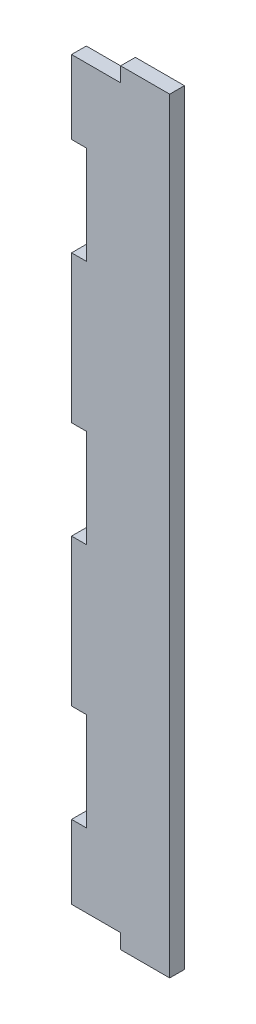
ISO-10303-21;
HEADER;
FILE_DESCRIPTION(('STEP AP214'),'2;1');
FILE_NAME('part.step','',(''),(''),'','','');
FILE_SCHEMA(('AUTOMOTIVE_DESIGN { 1 0 10303 214 1 1 1 1 }'));
ENDSEC;
DATA;
#1=APPLICATION_CONTEXT('core data for automotive mechanical design processes');
#2=APPLICATION_PROTOCOL_DEFINITION('international standard','automotive_design',2000,#1);
#3=PRODUCT_CONTEXT('',#1,'mechanical');
#4=PRODUCT('Part','Part','',(#3));
#5=PRODUCT_RELATED_PRODUCT_CATEGORY('part','',(#4));
#6=PRODUCT_DEFINITION_FORMATION('','',#4);
#7=PRODUCT_DEFINITION_CONTEXT('part definition',#1,'design');
#8=PRODUCT_DEFINITION('design','',#6,#7);
#9=PRODUCT_DEFINITION_SHAPE('','',#8);
#10=(LENGTH_UNIT() NAMED_UNIT(*) SI_UNIT(.MILLI.,.METRE.));
#11=(NAMED_UNIT(*) PLANE_ANGLE_UNIT() SI_UNIT($,.RADIAN.));
#12=(NAMED_UNIT(*) SI_UNIT($,.STERADIAN.) SOLID_ANGLE_UNIT());
#13=UNCERTAINTY_MEASURE_WITH_UNIT(LENGTH_MEASURE(1.E-05),#10,'distance_accuracy_value','');
#14=(GEOMETRIC_REPRESENTATION_CONTEXT(3) GLOBAL_UNCERTAINTY_ASSIGNED_CONTEXT((#13)) GLOBAL_UNIT_ASSIGNED_CONTEXT((#10,
#11,#12)) REPRESENTATION_CONTEXT('',''));
#15=CARTESIAN_POINT('',(0.,0.,0.));
#16=DIRECTION('',(0.,0.,1.));
#17=DIRECTION('',(1.,0.,0.));
#18=AXIS2_PLACEMENT_3D('',#15,#16,#17);
#19=CARTESIAN_POINT('',(-10.,-75.,3.));
#20=DIRECTION('',(1.,0.,0.));
#21=DIRECTION('',(0.,0.,-1.));
#22=AXIS2_PLACEMENT_3D('',#19,#20,#21);
#23=PLANE('',#22);
#24=DIRECTION('',(0.,-1.,0.));
#25=VECTOR('',#24,1.);
#26=CARTESIAN_POINT('',(-10.,-75.,0.));
#27=LINE('',#26,#25);
#28=CARTESIAN_POINT('',(-10.,75.,0.));
#29=VERTEX_POINT('',#28);
#30=CARTESIAN_POINT('',(-10.,60.,0.));
#31=VERTEX_POINT('',#30);
#32=EDGE_CURVE('E197',#29,#31,#27,.T.);
#33=ORIENTED_EDGE('',*,*,#32,.T.);
#34=DIRECTION('',(0.,0.,1.));
#35=VECTOR('',#34,1.);
#36=CARTESIAN_POINT('',(-10.,60.,0.));
#37=LINE('',#36,#35);
#38=CARTESIAN_POINT('',(-10.,60.,3.));
#39=VERTEX_POINT('',#38);
#40=EDGE_CURVE('E284',#31,#39,#37,.T.);
#41=ORIENTED_EDGE('',*,*,#40,.T.);
#42=DIRECTION('',(0.,-1.,0.));
#43=VECTOR('',#42,1.);
#44=CARTESIAN_POINT('',(-10.,-75.,3.));
#45=LINE('',#44,#43);
#46=CARTESIAN_POINT('',(-10.,75.,3.));
#47=VERTEX_POINT('',#46);
#48=EDGE_CURVE('E223',#47,#39,#45,.T.);
#49=ORIENTED_EDGE('',*,*,#48,.F.);
#50=DIRECTION('',(0.,0.,-1.));
#51=VECTOR('',#50,1.);
#52=CARTESIAN_POINT('',(-10.,75.,3.));
#53=LINE('',#52,#51);
#54=EDGE_CURVE('E11',#47,#29,#53,.T.);
#55=ORIENTED_EDGE('',*,*,#54,.T.);
#56=EDGE_LOOP('',(#33,#41,#49,#55));
#57=FACE_BOUND('',#56,.T.);
#58=ADVANCED_FACE('F35',(#57),#23,.F.);
#59=CARTESIAN_POINT('',(-10.,-60.,3.));
#60=VERTEX_POINT('',#59);
#61=CARTESIAN_POINT('',(-10.,-75.,3.));
#62=VERTEX_POINT('',#61);
#63=EDGE_CURVE('E226',#60,#62,#45,.T.);
#64=ORIENTED_EDGE('',*,*,#63,.F.);
#65=DIRECTION('',(0.,0.,1.));
#66=VECTOR('',#65,1.);
#67=CARTESIAN_POINT('',(-10.,-60.,0.));
#68=LINE('',#67,#66);
#69=CARTESIAN_POINT('',(-10.,-60.,0.));
#70=VERTEX_POINT('',#69);
#71=EDGE_CURVE('E297',#70,#60,#68,.T.);
#72=ORIENTED_EDGE('',*,*,#71,.F.);
#73=CARTESIAN_POINT('',(-10.,-75.,0.));
#74=VERTEX_POINT('',#73);
#75=EDGE_CURVE('E200',#70,#74,#27,.T.);
#76=ORIENTED_EDGE('',*,*,#75,.T.);
#77=DIRECTION('',(0.,0.,-1.));
#78=VECTOR('',#77,1.);
#79=CARTESIAN_POINT('',(-10.,-75.,3.));
#80=LINE('',#79,#78);
#81=EDGE_CURVE('E43',#62,#74,#80,.T.);
#82=ORIENTED_EDGE('',*,*,#81,.F.);
#83=EDGE_LOOP('',(#64,#72,#76,#82));
#84=FACE_BOUND('',#83,.T.);
#85=ADVANCED_FACE('F365',(#84),#23,.F.);
#86=CARTESIAN_POINT('',(-10.,40.,3.));
#87=VERTEX_POINT('',#86);
#88=CARTESIAN_POINT('',(-10.,10.,3.));
#89=VERTEX_POINT('',#88);
#90=EDGE_CURVE('E188',#87,#89,#45,.T.);
#91=ORIENTED_EDGE('',*,*,#90,.F.);
#92=DIRECTION('',(0.,0.,1.));
#93=VECTOR('',#92,1.);
#94=CARTESIAN_POINT('',(-10.,40.,0.));
#95=LINE('',#94,#93);
#96=CARTESIAN_POINT('',(-10.,40.,0.));
#97=VERTEX_POINT('',#96);
#98=EDGE_CURVE('E175',#97,#87,#95,.T.);
#99=ORIENTED_EDGE('',*,*,#98,.F.);
#100=CARTESIAN_POINT('',(-10.,10.,0.));
#101=VERTEX_POINT('',#100);
#102=EDGE_CURVE('E186',#97,#101,#27,.T.);
#103=ORIENTED_EDGE('',*,*,#102,.T.);
#104=DIRECTION('',(0.,0.,1.));
#105=VECTOR('',#104,1.);
#106=CARTESIAN_POINT('',(-10.,10.,0.));
#107=LINE('',#106,#105);
#108=EDGE_CURVE('E263',#101,#89,#107,.T.);
#109=ORIENTED_EDGE('',*,*,#108,.T.);
#110=EDGE_LOOP('',(#91,#99,#103,#109));
#111=FACE_BOUND('',#110,.T.);
#112=ADVANCED_FACE('F184',(#111),#23,.F.);
#113=CARTESIAN_POINT('',(-10.,-75.,3.));
#114=DIRECTION('',(0.,1.,0.));
#115=DIRECTION('',(0.,0.,1.));
#116=AXIS2_PLACEMENT_3D('',#113,#114,#115);
#117=PLANE('',#116);
#118=DIRECTION('',(0.,0.,-1.));
#119=VECTOR('',#118,1.);
#120=CARTESIAN_POINT('',(0.,-75.,3.));
#121=LINE('',#120,#119);
#122=CARTESIAN_POINT('',(0.,-75.,3.));
#123=VERTEX_POINT('',#122);
#124=CARTESIAN_POINT('',(0.,-75.,0.));
#125=VERTEX_POINT('',#124);
#126=EDGE_CURVE('E245',#123,#125,#121,.T.);
#127=ORIENTED_EDGE('',*,*,#126,.F.);
#128=DIRECTION('',(1.,0.,0.));
#129=VECTOR('',#128,1.);
#130=CARTESIAN_POINT('',(-10.,-75.,3.));
#131=LINE('',#130,#129);
#132=EDGE_CURVE('E220',#62,#123,#131,.T.);
#133=ORIENTED_EDGE('',*,*,#132,.F.);
#134=ORIENTED_EDGE('',*,*,#81,.T.);
#135=DIRECTION('',(1.,0.,0.));
#136=VECTOR('',#135,1.);
#137=CARTESIAN_POINT('',(-10.,-75.,0.));
#138=LINE('',#137,#136);
#139=EDGE_CURVE('E202',#74,#125,#138,.T.);
#140=ORIENTED_EDGE('',*,*,#139,.T.);
#141=EDGE_LOOP('',(#127,#133,#134,#140));
#142=FACE_BOUND('',#141,.T.);
#143=ADVANCED_FACE('F361',(#142),#117,.F.);
#144=CARTESIAN_POINT('',(10.,-75.,3.));
#145=DIRECTION('',(-1.,0.,0.));
#146=DIRECTION('',(0.,0.,1.));
#147=AXIS2_PLACEMENT_3D('',#144,#145,#146);
#148=PLANE('',#147);
#149=DIRECTION('',(0.,1.,0.));
#150=VECTOR('',#149,1.);
#151=CARTESIAN_POINT('',(10.,-75.,0.));
#152=LINE('',#151,#150);
#153=CARTESIAN_POINT('',(10.,-78.,0.));
#154=VERTEX_POINT('',#153);
#155=CARTESIAN_POINT('',(10.,78.,0.));
#156=VERTEX_POINT('',#155);
#157=EDGE_CURVE('E212',#154,#156,#152,.T.);
#158=ORIENTED_EDGE('',*,*,#157,.T.);
#159=DIRECTION('',(0.,0.,-1.));
#160=VECTOR('',#159,1.);
#161=CARTESIAN_POINT('',(10.,78.,3.));
#162=LINE('',#161,#160);
#163=CARTESIAN_POINT('',(10.,78.,3.));
#164=VERTEX_POINT('',#163);
#165=EDGE_CURVE('E233',#164,#156,#162,.T.);
#166=ORIENTED_EDGE('',*,*,#165,.F.);
#167=DIRECTION('',(0.,1.,0.));
#168=VECTOR('',#167,1.);
#169=CARTESIAN_POINT('',(10.,-75.,3.));
#170=LINE('',#169,#168);
#171=CARTESIAN_POINT('',(10.,-78.,3.));
#172=VERTEX_POINT('',#171);
#173=EDGE_CURVE('E230',#172,#164,#170,.T.);
#174=ORIENTED_EDGE('',*,*,#173,.F.);
#175=DIRECTION('',(0.,0.,-1.));
#176=VECTOR('',#175,1.);
#177=CARTESIAN_POINT('',(10.,-78.,3.));
#178=LINE('',#177,#176);
#179=EDGE_CURVE('E253',#172,#154,#178,.T.);
#180=ORIENTED_EDGE('',*,*,#179,.T.);
#181=EDGE_LOOP('',(#158,#166,#174,#180));
#182=FACE_BOUND('',#181,.T.);
#183=ADVANCED_FACE('F37',(#182),#148,.F.);
#184=CARTESIAN_POINT('',(-10.,75.,3.));
#185=DIRECTION('',(0.,-1.,0.));
#186=DIRECTION('',(0.,0.,-1.));
#187=AXIS2_PLACEMENT_3D('',#184,#185,#186);
#188=PLANE('',#187);
#189=DIRECTION('',(-1.,0.,0.));
#190=VECTOR('',#189,1.);
#191=CARTESIAN_POINT('',(-10.,75.,3.));
#192=LINE('',#191,#190);
#193=CARTESIAN_POINT('',(0.,75.,3.));
#194=VERTEX_POINT('',#193);
#195=EDGE_CURVE('E228',#194,#47,#192,.T.);
#196=ORIENTED_EDGE('',*,*,#195,.F.);
#197=DIRECTION('',(0.,0.,-1.));
#198=VECTOR('',#197,1.);
#199=CARTESIAN_POINT('',(0.,75.,3.));
#200=LINE('',#199,#198);
#201=CARTESIAN_POINT('',(0.,75.,0.));
#202=VERTEX_POINT('',#201);
#203=EDGE_CURVE('E217',#194,#202,#200,.T.);
#204=ORIENTED_EDGE('',*,*,#203,.T.);
#205=DIRECTION('',(-1.,0.,0.));
#206=VECTOR('',#205,1.);
#207=CARTESIAN_POINT('',(-10.,75.,0.));
#208=LINE('',#207,#206);
#209=EDGE_CURVE('E206',#202,#29,#208,.T.);
#210=ORIENTED_EDGE('',*,*,#209,.T.);
#211=ORIENTED_EDGE('',*,*,#54,.F.);
#212=EDGE_LOOP('',(#196,#204,#210,#211));
#213=FACE_BOUND('',#212,.T.);
#214=ADVANCED_FACE('F332',(#213),#188,.F.);
#215=CARTESIAN_POINT('',(-10.,-10.,0.));
#216=VERTEX_POINT('',#215);
#217=CARTESIAN_POINT('',(-10.,-40.,0.));
#218=VERTEX_POINT('',#217);
#219=EDGE_CURVE('E198',#216,#218,#27,.T.);
#220=ORIENTED_EDGE('',*,*,#219,.T.);
#221=DIRECTION('',(0.,0.,1.));
#222=VECTOR('',#221,1.);
#223=CARTESIAN_POINT('',(-10.,-40.,0.));
#224=LINE('',#223,#222);
#225=CARTESIAN_POINT('',(-10.,-40.,3.));
#226=VERTEX_POINT('',#225);
#227=EDGE_CURVE('E294',#218,#226,#224,.T.);
#228=ORIENTED_EDGE('',*,*,#227,.T.);
#229=CARTESIAN_POINT('',(-10.,-10.,3.));
#230=VERTEX_POINT('',#229);
#231=EDGE_CURVE('E227',#230,#226,#45,.T.);
#232=ORIENTED_EDGE('',*,*,#231,.F.);
#233=DIRECTION('',(0.,0.,1.));
#234=VECTOR('',#233,1.);
#235=CARTESIAN_POINT('',(-10.,-10.,0.));
#236=LINE('',#235,#234);
#237=EDGE_CURVE('E267',#216,#230,#236,.T.);
#238=ORIENTED_EDGE('',*,*,#237,.F.);
#239=EDGE_LOOP('',(#220,#228,#232,#238));
#240=FACE_BOUND('',#239,.T.);
#241=ADVANCED_FACE('F372',(#240),#23,.F.);
#242=CARTESIAN_POINT('',(0.,0.,3.));
#243=DIRECTION('',(0.,0.,-1.));
#244=DIRECTION('',(-1.,0.,0.));
#245=AXIS2_PLACEMENT_3D('',#242,#243,#244);
#246=PLANE('',#245);
#247=ORIENTED_EDGE('',*,*,#48,.T.);
#248=DIRECTION('',(-1.,0.,0.));
#249=VECTOR('',#248,1.);
#250=CARTESIAN_POINT('',(-10.,60.,3.));
#251=LINE('',#250,#249);
#252=CARTESIAN_POINT('',(-7.,60.,3.));
#253=VERTEX_POINT('',#252);
#254=EDGE_CURVE('E180',#253,#39,#251,.T.);
#255=ORIENTED_EDGE('',*,*,#254,.F.);
#256=DIRECTION('',(0.,1.,0.));
#257=VECTOR('',#256,1.);
#258=CARTESIAN_POINT('',(-7.,60.,3.));
#259=LINE('',#258,#257);
#260=CARTESIAN_POINT('',(-7.,40.,3.));
#261=VERTEX_POINT('',#260);
#262=EDGE_CURVE('E321',#261,#253,#259,.T.);
#263=ORIENTED_EDGE('',*,*,#262,.F.);
#264=DIRECTION('',(1.,0.,0.));
#265=VECTOR('',#264,1.);
#266=CARTESIAN_POINT('',(-10.,40.,3.));
#267=LINE('',#266,#265);
#268=EDGE_CURVE('E299',#87,#261,#267,.T.);
#269=ORIENTED_EDGE('',*,*,#268,.F.);
#270=ORIENTED_EDGE('',*,*,#90,.T.);
#271=DIRECTION('',(-1.,0.,0.));
#272=VECTOR('',#271,1.);
#273=CARTESIAN_POINT('',(-10.,10.,3.));
#274=LINE('',#273,#272);
#275=CARTESIAN_POINT('',(-7.00000000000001,10.,3.));
#276=VERTEX_POINT('',#275);
#277=EDGE_CURVE('E274',#276,#89,#274,.T.);
#278=ORIENTED_EDGE('',*,*,#277,.F.);
#279=DIRECTION('',(0.,1.,0.));
#280=VECTOR('',#279,1.);
#281=CARTESIAN_POINT('',(-7.00000000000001,10.,3.));
#282=LINE('',#281,#280);
#283=CARTESIAN_POINT('',(-7.00000000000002,-10.,3.));
#284=VERTEX_POINT('',#283);
#285=EDGE_CURVE('E278',#284,#276,#282,.T.);
#286=ORIENTED_EDGE('',*,*,#285,.F.);
#287=DIRECTION('',(1.,0.,0.));
#288=VECTOR('',#287,1.);
#289=CARTESIAN_POINT('',(-10.,-10.,3.));
#290=LINE('',#289,#288);
#291=EDGE_CURVE('E281',#230,#284,#290,.T.);
#292=ORIENTED_EDGE('',*,*,#291,.F.);
#293=ORIENTED_EDGE('',*,*,#231,.T.);
#294=DIRECTION('',(-1.,0.,0.));
#295=VECTOR('',#294,1.);
#296=CARTESIAN_POINT('',(-10.,-40.,3.));
#297=LINE('',#296,#295);
#298=CARTESIAN_POINT('',(-7.,-40.,3.));
#299=VERTEX_POINT('',#298);
#300=EDGE_CURVE('E300',#299,#226,#297,.T.);
#301=ORIENTED_EDGE('',*,*,#300,.F.);
#302=DIRECTION('',(0.,1.,0.));
#303=VECTOR('',#302,1.);
#304=CARTESIAN_POINT('',(-7.,-60.,3.));
#305=LINE('',#304,#303);
#306=CARTESIAN_POINT('',(-7.,-60.,3.));
#307=VERTEX_POINT('',#306);
#308=EDGE_CURVE('E303',#307,#299,#305,.T.);
#309=ORIENTED_EDGE('',*,*,#308,.F.);
#310=DIRECTION('',(1.,0.,0.));
#311=VECTOR('',#310,1.);
#312=CARTESIAN_POINT('',(-10.,-60.,3.));
#313=LINE('',#312,#311);
#314=EDGE_CURVE('E306',#60,#307,#313,.T.);
#315=ORIENTED_EDGE('',*,*,#314,.F.);
#316=ORIENTED_EDGE('',*,*,#63,.T.);
#317=ORIENTED_EDGE('',*,*,#132,.T.);
#318=DIRECTION('',(0.,-1.,0.));
#319=VECTOR('',#318,1.);
#320=CARTESIAN_POINT('',(0.,-75.,3.));
#321=LINE('',#320,#319);
#322=CARTESIAN_POINT('',(0.,-78.,3.));
#323=VERTEX_POINT('',#322);
#324=EDGE_CURVE('E260',#123,#323,#321,.T.);
#325=ORIENTED_EDGE('',*,*,#324,.T.);
#326=DIRECTION('',(1.,0.,0.));
#327=VECTOR('',#326,1.);
#328=CARTESIAN_POINT('',(0.,-78.,3.));
#329=LINE('',#328,#327);
#330=EDGE_CURVE('E256',#323,#172,#329,.T.);
#331=ORIENTED_EDGE('',*,*,#330,.T.);
#332=ORIENTED_EDGE('',*,*,#173,.T.);
#333=DIRECTION('',(-1.,0.,0.));
#334=VECTOR('',#333,1.);
#335=CARTESIAN_POINT('',(0.,78.,3.));
#336=LINE('',#335,#334);
#337=CARTESIAN_POINT('',(0.,78.,3.));
#338=VERTEX_POINT('',#337);
#339=EDGE_CURVE('E239',#164,#338,#336,.T.);
#340=ORIENTED_EDGE('',*,*,#339,.T.);
#341=DIRECTION('',(0.,-1.,0.));
#342=VECTOR('',#341,1.);
#343=CARTESIAN_POINT('',(0.,75.,3.));
#344=LINE('',#343,#342);
#345=EDGE_CURVE('E242',#338,#194,#344,.T.);
#346=ORIENTED_EDGE('',*,*,#345,.T.);
#347=ORIENTED_EDGE('',*,*,#195,.T.);
#348=EDGE_LOOP('',(#247,#255,#263,#269,#270,#278,#286,#292,#293,#301,#309,#315,#316,#317,#325,
#331,#332,#340,#346,#347));
#349=FACE_BOUND('',#348,.T.);
#350=ADVANCED_FACE('F335',(#349),#246,.F.);
#351=CARTESIAN_POINT('',(0.,0.,0.));
#352=DIRECTION('',(0.,0.,-1.));
#353=DIRECTION('',(-1.,0.,0.));
#354=AXIS2_PLACEMENT_3D('',#351,#352,#353);
#355=PLANE('',#354);
#356=DIRECTION('',(-1.,0.,0.));
#357=VECTOR('',#356,1.);
#358=CARTESIAN_POINT('',(-10.,60.,0.));
#359=LINE('',#358,#357);
#360=CARTESIAN_POINT('',(-7.,60.,0.));
#361=VERTEX_POINT('',#360);
#362=EDGE_CURVE('E189',#361,#31,#359,.T.);
#363=ORIENTED_EDGE('',*,*,#362,.T.);
#364=ORIENTED_EDGE('',*,*,#32,.F.);
#365=ORIENTED_EDGE('',*,*,#209,.F.);
#366=DIRECTION('',(0.,-1.,0.));
#367=VECTOR('',#366,1.);
#368=CARTESIAN_POINT('',(0.,75.,0.));
#369=LINE('',#368,#367);
#370=CARTESIAN_POINT('',(0.,78.,0.));
#371=VERTEX_POINT('',#370);
#372=EDGE_CURVE('E243',#371,#202,#369,.T.);
#373=ORIENTED_EDGE('',*,*,#372,.F.);
#374=DIRECTION('',(-1.,0.,0.));
#375=VECTOR('',#374,1.);
#376=CARTESIAN_POINT('',(0.,78.,0.));
#377=LINE('',#376,#375);
#378=EDGE_CURVE('E240',#156,#371,#377,.T.);
#379=ORIENTED_EDGE('',*,*,#378,.F.);
#380=ORIENTED_EDGE('',*,*,#157,.F.);
#381=DIRECTION('',(1.,0.,0.));
#382=VECTOR('',#381,1.);
#383=CARTESIAN_POINT('',(0.,-78.,0.));
#384=LINE('',#383,#382);
#385=CARTESIAN_POINT('',(0.,-78.,0.));
#386=VERTEX_POINT('',#385);
#387=EDGE_CURVE('E257',#386,#154,#384,.T.);
#388=ORIENTED_EDGE('',*,*,#387,.F.);
#389=DIRECTION('',(0.,-1.,0.));
#390=VECTOR('',#389,1.);
#391=CARTESIAN_POINT('',(0.,-75.,0.));
#392=LINE('',#391,#390);
#393=EDGE_CURVE('E261',#125,#386,#392,.T.);
#394=ORIENTED_EDGE('',*,*,#393,.F.);
#395=ORIENTED_EDGE('',*,*,#139,.F.);
#396=ORIENTED_EDGE('',*,*,#75,.F.);
#397=DIRECTION('',(1.,0.,0.));
#398=VECTOR('',#397,1.);
#399=CARTESIAN_POINT('',(-10.,-60.,0.));
#400=LINE('',#399,#398);
#401=CARTESIAN_POINT('',(-7.,-60.,0.));
#402=VERTEX_POINT('',#401);
#403=EDGE_CURVE('E302',#70,#402,#400,.T.);
#404=ORIENTED_EDGE('',*,*,#403,.T.);
#405=DIRECTION('',(0.,1.,0.));
#406=VECTOR('',#405,1.);
#407=CARTESIAN_POINT('',(-7.,-60.,0.));
#408=LINE('',#407,#406);
#409=CARTESIAN_POINT('',(-7.,-40.,0.));
#410=VERTEX_POINT('',#409);
#411=EDGE_CURVE('E310',#402,#410,#408,.T.);
#412=ORIENTED_EDGE('',*,*,#411,.T.);
#413=DIRECTION('',(-1.,0.,0.));
#414=VECTOR('',#413,1.);
#415=CARTESIAN_POINT('',(-10.,-40.,0.));
#416=LINE('',#415,#414);
#417=EDGE_CURVE('E58',#410,#218,#416,.T.);
#418=ORIENTED_EDGE('',*,*,#417,.T.);
#419=ORIENTED_EDGE('',*,*,#219,.F.);
#420=DIRECTION('',(1.,0.,0.));
#421=VECTOR('',#420,1.);
#422=CARTESIAN_POINT('',(-10.,-10.,0.));
#423=LINE('',#422,#421);
#424=CARTESIAN_POINT('',(-7.00000000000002,-10.,0.));
#425=VERTEX_POINT('',#424);
#426=EDGE_CURVE('E277',#216,#425,#423,.T.);
#427=ORIENTED_EDGE('',*,*,#426,.T.);
#428=DIRECTION('',(0.,1.,0.));
#429=VECTOR('',#428,1.);
#430=CARTESIAN_POINT('',(-7.00000000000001,10.,0.));
#431=LINE('',#430,#429);
#432=CARTESIAN_POINT('',(-7.00000000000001,10.,0.));
#433=VERTEX_POINT('',#432);
#434=EDGE_CURVE('E286',#425,#433,#431,.T.);
#435=ORIENTED_EDGE('',*,*,#434,.T.);
#436=DIRECTION('',(-1.,0.,0.));
#437=VECTOR('',#436,1.);
#438=CARTESIAN_POINT('',(-10.,10.,0.));
#439=LINE('',#438,#437);
#440=EDGE_CURVE('E196',#433,#101,#439,.T.);
#441=ORIENTED_EDGE('',*,*,#440,.T.);
#442=ORIENTED_EDGE('',*,*,#102,.F.);
#443=DIRECTION('',(1.,0.,0.));
#444=VECTOR('',#443,1.);
#445=CARTESIAN_POINT('',(-10.,40.,0.));
#446=LINE('',#445,#444);
#447=CARTESIAN_POINT('',(-7.,40.,0.));
#448=VERTEX_POINT('',#447);
#449=EDGE_CURVE('E171',#97,#448,#446,.T.);
#450=ORIENTED_EDGE('',*,*,#449,.T.);
#451=DIRECTION('',(0.,1.,0.));
#452=VECTOR('',#451,1.);
#453=CARTESIAN_POINT('',(-7.,60.,0.));
#454=LINE('',#453,#452);
#455=EDGE_CURVE('E50',#448,#361,#454,.T.);
#456=ORIENTED_EDGE('',*,*,#455,.T.);
#457=EDGE_LOOP('',(#363,#364,#365,#373,#379,#380,#388,#394,#395,#396,#404,#412,#418,#419,#427,
#435,#441,#442,#450,#456));
#458=FACE_BOUND('',#457,.T.);
#459=ADVANCED_FACE('F193',(#458),#355,.T.);
#460=CARTESIAN_POINT('',(0.,75.,3.));
#461=DIRECTION('',(1.,0.,0.));
#462=DIRECTION('',(0.,0.,-1.));
#463=AXIS2_PLACEMENT_3D('',#460,#461,#462);
#464=PLANE('',#463);
#465=ORIENTED_EDGE('',*,*,#372,.T.);
#466=ORIENTED_EDGE('',*,*,#203,.F.);
#467=ORIENTED_EDGE('',*,*,#345,.F.);
#468=DIRECTION('',(0.,0.,-1.));
#469=VECTOR('',#468,1.);
#470=CARTESIAN_POINT('',(0.,78.,3.));
#471=LINE('',#470,#469);
#472=EDGE_CURVE('E236',#338,#371,#471,.T.);
#473=ORIENTED_EDGE('',*,*,#472,.T.);
#474=EDGE_LOOP('',(#465,#466,#467,#473));
#475=FACE_BOUND('',#474,.T.);
#476=ADVANCED_FACE('F341',(#475),#464,.F.);
#477=CARTESIAN_POINT('',(0.,78.,3.));
#478=DIRECTION('',(0.,-1.,0.));
#479=DIRECTION('',(0.,0.,-1.));
#480=AXIS2_PLACEMENT_3D('',#477,#478,#479);
#481=PLANE('',#480);
#482=ORIENTED_EDGE('',*,*,#378,.T.);
#483=ORIENTED_EDGE('',*,*,#472,.F.);
#484=ORIENTED_EDGE('',*,*,#339,.F.);
#485=ORIENTED_EDGE('',*,*,#165,.T.);
#486=EDGE_LOOP('',(#482,#483,#484,#485));
#487=FACE_BOUND('',#486,.T.);
#488=ADVANCED_FACE('F346',(#487),#481,.F.);
#489=CARTESIAN_POINT('',(0.,-75.,3.));
#490=DIRECTION('',(1.,0.,0.));
#491=DIRECTION('',(0.,0.,-1.));
#492=AXIS2_PLACEMENT_3D('',#489,#490,#491);
#493=PLANE('',#492);
#494=ORIENTED_EDGE('',*,*,#393,.T.);
#495=DIRECTION('',(0.,0.,-1.));
#496=VECTOR('',#495,1.);
#497=CARTESIAN_POINT('',(0.,-78.,3.));
#498=LINE('',#497,#496);
#499=EDGE_CURVE('E250',#323,#386,#498,.T.);
#500=ORIENTED_EDGE('',*,*,#499,.F.);
#501=ORIENTED_EDGE('',*,*,#324,.F.);
#502=ORIENTED_EDGE('',*,*,#126,.T.);
#503=EDGE_LOOP('',(#494,#500,#501,#502));
#504=FACE_BOUND('',#503,.T.);
#505=ADVANCED_FACE('F358',(#504),#493,.F.);
#506=CARTESIAN_POINT('',(0.,-78.,3.));
#507=DIRECTION('',(0.,1.,0.));
#508=DIRECTION('',(0.,0.,1.));
#509=AXIS2_PLACEMENT_3D('',#506,#507,#508);
#510=PLANE('',#509);
#511=ORIENTED_EDGE('',*,*,#387,.T.);
#512=ORIENTED_EDGE('',*,*,#179,.F.);
#513=ORIENTED_EDGE('',*,*,#330,.F.);
#514=ORIENTED_EDGE('',*,*,#499,.T.);
#515=EDGE_LOOP('',(#511,#512,#513,#514));
#516=FACE_BOUND('',#515,.T.);
#517=ADVANCED_FACE('F352',(#516),#510,.F.);
#518=CARTESIAN_POINT('',(-10.,10.,0.));
#519=DIRECTION('',(0.,1.,0.));
#520=DIRECTION('',(0.,0.,1.));
#521=AXIS2_PLACEMENT_3D('',#518,#519,#520);
#522=PLANE('',#521);
#523=ORIENTED_EDGE('',*,*,#277,.T.);
#524=ORIENTED_EDGE('',*,*,#108,.F.);
#525=ORIENTED_EDGE('',*,*,#440,.F.);
#526=DIRECTION('',(0.,0.,1.));
#527=VECTOR('',#526,1.);
#528=CARTESIAN_POINT('',(-7.00000000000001,10.,0.));
#529=LINE('',#528,#527);
#530=EDGE_CURVE('E271',#433,#276,#529,.T.);
#531=ORIENTED_EDGE('',*,*,#530,.T.);
#532=EDGE_LOOP('',(#523,#524,#525,#531));
#533=FACE_BOUND('',#532,.T.);
#534=ADVANCED_FACE('F426',(#533),#522,.F.);
#535=CARTESIAN_POINT('',(-7.00000000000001,10.,0.));
#536=DIRECTION('',(1.,0.,0.));
#537=DIRECTION('',(0.,1.,0.));
#538=AXIS2_PLACEMENT_3D('',#535,#536,#537);
#539=PLANE('',#538);
#540=ORIENTED_EDGE('',*,*,#285,.T.);
#541=ORIENTED_EDGE('',*,*,#530,.F.);
#542=ORIENTED_EDGE('',*,*,#434,.F.);
#543=DIRECTION('',(0.,0.,1.));
#544=VECTOR('',#543,1.);
#545=CARTESIAN_POINT('',(-7.00000000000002,-10.,0.));
#546=LINE('',#545,#544);
#547=EDGE_CURVE('E269',#425,#284,#546,.T.);
#548=ORIENTED_EDGE('',*,*,#547,.T.);
#549=EDGE_LOOP('',(#540,#541,#542,#548));
#550=FACE_BOUND('',#549,.T.);
#551=ADVANCED_FACE('F431',(#550),#539,.F.);
#552=CARTESIAN_POINT('',(-10.,-10.,0.));
#553=DIRECTION('',(0.,-1.,0.));
#554=DIRECTION('',(0.,0.,-1.));
#555=AXIS2_PLACEMENT_3D('',#552,#553,#554);
#556=PLANE('',#555);
#557=ORIENTED_EDGE('',*,*,#291,.T.);
#558=ORIENTED_EDGE('',*,*,#547,.F.);
#559=ORIENTED_EDGE('',*,*,#426,.F.);
#560=ORIENTED_EDGE('',*,*,#237,.T.);
#561=EDGE_LOOP('',(#557,#558,#559,#560));
#562=FACE_BOUND('',#561,.T.);
#563=ADVANCED_FACE('F443',(#562),#556,.F.);
#564=CARTESIAN_POINT('',(-10.,-60.,0.));
#565=DIRECTION('',(0.,-1.,0.));
#566=DIRECTION('',(0.,0.,-1.));
#567=AXIS2_PLACEMENT_3D('',#564,#565,#566);
#568=PLANE('',#567);
#569=ORIENTED_EDGE('',*,*,#314,.T.);
#570=DIRECTION('',(0.,0.,1.));
#571=VECTOR('',#570,1.);
#572=CARTESIAN_POINT('',(-7.,-60.,0.));
#573=LINE('',#572,#571);
#574=EDGE_CURVE('E290',#402,#307,#573,.T.);
#575=ORIENTED_EDGE('',*,*,#574,.F.);
#576=ORIENTED_EDGE('',*,*,#403,.F.);
#577=ORIENTED_EDGE('',*,*,#71,.T.);
#578=EDGE_LOOP('',(#569,#575,#576,#577));
#579=FACE_BOUND('',#578,.T.);
#580=ADVANCED_FACE('F453',(#579),#568,.F.);
#581=CARTESIAN_POINT('',(-10.,-40.,0.));
#582=DIRECTION('',(0.,1.,0.));
#583=DIRECTION('',(0.,0.,1.));
#584=AXIS2_PLACEMENT_3D('',#581,#582,#583);
#585=PLANE('',#584);
#586=ORIENTED_EDGE('',*,*,#300,.T.);
#587=ORIENTED_EDGE('',*,*,#227,.F.);
#588=ORIENTED_EDGE('',*,*,#417,.F.);
#589=DIRECTION('',(0.,0.,1.));
#590=VECTOR('',#589,1.);
#591=CARTESIAN_POINT('',(-7.,-40.,0.));
#592=LINE('',#591,#590);
#593=EDGE_CURVE('E292',#410,#299,#592,.T.);
#594=ORIENTED_EDGE('',*,*,#593,.T.);
#595=EDGE_LOOP('',(#586,#587,#588,#594));
#596=FACE_BOUND('',#595,.T.);
#597=ADVANCED_FACE('F463',(#596),#585,.F.);
#598=CARTESIAN_POINT('',(-7.,-60.,0.));
#599=DIRECTION('',(1.,0.,0.));
#600=DIRECTION('',(0.,1.,0.));
#601=AXIS2_PLACEMENT_3D('',#598,#599,#600);
#602=PLANE('',#601);
#603=ORIENTED_EDGE('',*,*,#308,.T.);
#604=ORIENTED_EDGE('',*,*,#593,.F.);
#605=ORIENTED_EDGE('',*,*,#411,.F.);
#606=ORIENTED_EDGE('',*,*,#574,.T.);
#607=EDGE_LOOP('',(#603,#604,#605,#606));
#608=FACE_BOUND('',#607,.T.);
#609=ADVANCED_FACE('F473',(#608),#602,.F.);
#610=CARTESIAN_POINT('',(-10.,60.,0.));
#611=DIRECTION('',(0.,1.,0.));
#612=DIRECTION('',(0.,0.,1.));
#613=AXIS2_PLACEMENT_3D('',#610,#611,#612);
#614=PLANE('',#613);
#615=ORIENTED_EDGE('',*,*,#254,.T.);
#616=ORIENTED_EDGE('',*,*,#40,.F.);
#617=ORIENTED_EDGE('',*,*,#362,.F.);
#618=DIRECTION('',(0.,0.,1.));
#619=VECTOR('',#618,1.);
#620=CARTESIAN_POINT('',(-7.,60.,0.));
#621=LINE('',#620,#619);
#622=EDGE_CURVE('E316',#361,#253,#621,.T.);
#623=ORIENTED_EDGE('',*,*,#622,.T.);
#624=EDGE_LOOP('',(#615,#616,#617,#623));
#625=FACE_BOUND('',#624,.T.);
#626=ADVANCED_FACE('F482',(#625),#614,.F.);
#627=CARTESIAN_POINT('',(-7.,60.,0.));
#628=DIRECTION('',(1.,0.,0.));
#629=DIRECTION('',(0.,1.,0.));
#630=AXIS2_PLACEMENT_3D('',#627,#628,#629);
#631=PLANE('',#630);
#632=ORIENTED_EDGE('',*,*,#262,.T.);
#633=ORIENTED_EDGE('',*,*,#622,.F.);
#634=ORIENTED_EDGE('',*,*,#455,.F.);
#635=DIRECTION('',(0.,0.,1.));
#636=VECTOR('',#635,1.);
#637=CARTESIAN_POINT('',(-7.,40.,0.));
#638=LINE('',#637,#636);
#639=EDGE_CURVE('E177',#448,#261,#638,.T.);
#640=ORIENTED_EDGE('',*,*,#639,.T.);
#641=EDGE_LOOP('',(#632,#633,#634,#640));
#642=FACE_BOUND('',#641,.T.);
#643=ADVANCED_FACE('F492',(#642),#631,.F.);
#644=CARTESIAN_POINT('',(-10.,40.,0.));
#645=DIRECTION('',(0.,-1.,0.));
#646=DIRECTION('',(0.,0.,-1.));
#647=AXIS2_PLACEMENT_3D('',#644,#645,#646);
#648=PLANE('',#647);
#649=ORIENTED_EDGE('',*,*,#268,.T.);
#650=ORIENTED_EDGE('',*,*,#639,.F.);
#651=ORIENTED_EDGE('',*,*,#449,.F.);
#652=ORIENTED_EDGE('',*,*,#98,.T.);
#653=EDGE_LOOP('',(#649,#650,#651,#652));
#654=FACE_BOUND('',#653,.T.);
#655=ADVANCED_FACE('F174',(#654),#648,.F.);
#656=CLOSED_SHELL('',(#58,#85,#112,#143,#183,#214,#241,#350,#459,#476,#488,#505,#517,#534,#551,
#563,#580,#597,#609,#626,#643,#655));
#657=MANIFOLD_SOLID_BREP('B2',#656);
#658=ADVANCED_BREP_SHAPE_REPRESENTATION('',(#18,#657),#14);
#659=SHAPE_DEFINITION_REPRESENTATION(#9,#658);
ENDSEC;
END-ISO-10303-21;
